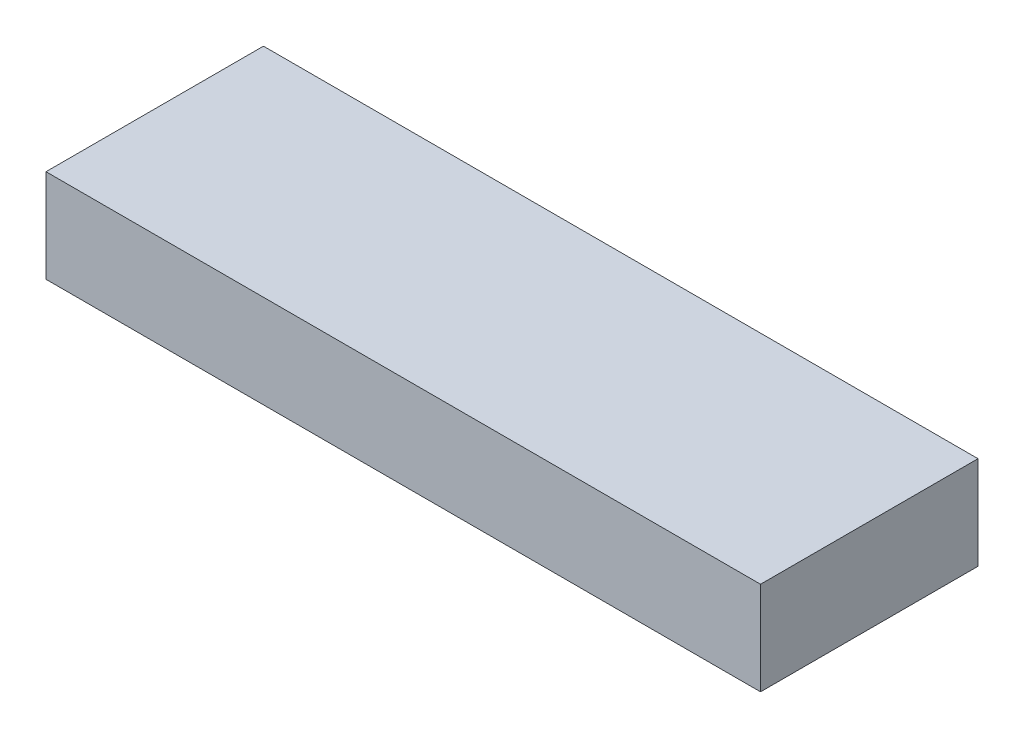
from build123d import *

# Parameters (mm, degrees)
SKETCH1_W           = 88.9
SKETCH1_H           = 38.1
BOSS_EXTRUDE1_DEPTH = 292.1


with BuildPart() as part:
    # Sketch1 → Boss-Extrude1 (new body)
    with BuildSketch(Plane(origin=(0, 0, 0), x_dir=(0, 0, -1), z_dir=(1, 0, 0))):
        with Locations((44.45, 19.05)):
            Rectangle(SKETCH1_W, SKETCH1_H)
    extrude(amount=BOSS_EXTRUDE1_DEPTH)


solid = part.part
